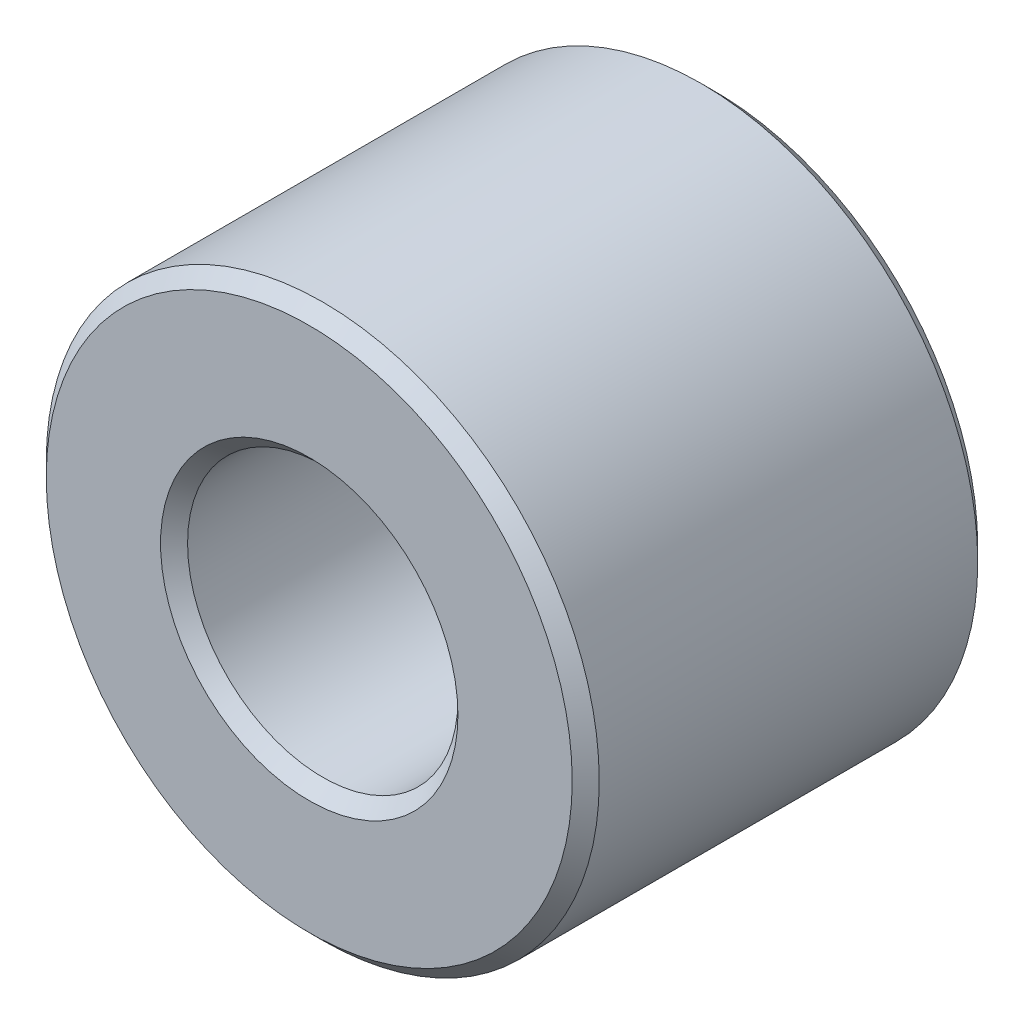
ISO-10303-21;
HEADER;
FILE_DESCRIPTION(('STEP AP214'),'2;1');
FILE_NAME('part.step','',(''),(''),'','','');
FILE_SCHEMA(('AUTOMOTIVE_DESIGN { 1 0 10303 214 1 1 1 1 }'));
ENDSEC;
DATA;
#1=APPLICATION_CONTEXT('core data for automotive mechanical design processes');
#2=APPLICATION_PROTOCOL_DEFINITION('international standard','automotive_design',2000,#1);
#3=PRODUCT_CONTEXT('',#1,'mechanical');
#4=PRODUCT('Part','Part','',(#3));
#5=PRODUCT_RELATED_PRODUCT_CATEGORY('part','',(#4));
#6=PRODUCT_DEFINITION_FORMATION('','',#4);
#7=PRODUCT_DEFINITION_CONTEXT('part definition',#1,'design');
#8=PRODUCT_DEFINITION('design','',#6,#7);
#9=PRODUCT_DEFINITION_SHAPE('','',#8);
#10=(LENGTH_UNIT() NAMED_UNIT(*) SI_UNIT(.MILLI.,.METRE.));
#11=(NAMED_UNIT(*) PLANE_ANGLE_UNIT() SI_UNIT($,.RADIAN.));
#12=(NAMED_UNIT(*) SI_UNIT($,.STERADIAN.) SOLID_ANGLE_UNIT());
#13=UNCERTAINTY_MEASURE_WITH_UNIT(LENGTH_MEASURE(1.E-05),#10,'distance_accuracy_value','');
#14=(GEOMETRIC_REPRESENTATION_CONTEXT(3) GLOBAL_UNCERTAINTY_ASSIGNED_CONTEXT((#13)) GLOBAL_UNIT_ASSIGNED_CONTEXT((#10,
#11,#12)) REPRESENTATION_CONTEXT('',''));
#15=CARTESIAN_POINT('',(0.,0.,0.));
#16=DIRECTION('',(0.,0.,1.));
#17=DIRECTION('',(1.,0.,0.));
#18=AXIS2_PLACEMENT_3D('',#15,#16,#17);
#19=CARTESIAN_POINT('',(0.,0.,16.5));
#20=DIRECTION('',(0.,0.,1.));
#21=DIRECTION('',(1.,0.,0.));
#22=AXIS2_PLACEMENT_3D('',#19,#20,#21);
#23=PLANE('',#22);
#24=CARTESIAN_POINT('',(0.,0.,16.5));
#25=DIRECTION('',(0.,0.,1.));
#26=DIRECTION('',(1.,0.,0.));
#27=AXIS2_PLACEMENT_3D('',#24,#25,#26);
#28=CIRCLE('',#27,12.1);
#29=CARTESIAN_POINT('',(12.1,0.,16.5));
#30=VERTEX_POINT('',#29);
#31=EDGE_CURVE('E10',#30,#30,#28,.F.);
#32=ORIENTED_EDGE('',*,*,#31,.T.);
#33=EDGE_LOOP('',(#32));
#34=FACE_BOUND('',#33,.T.);
#35=CARTESIAN_POINT('',(0.,0.,16.5));
#36=DIRECTION('',(0.,0.,1.));
#37=DIRECTION('',(1.,0.,0.));
#38=AXIS2_PLACEMENT_3D('',#35,#36,#37);
#39=CIRCLE('',#38,21.4);
#40=CARTESIAN_POINT('',(21.4,0.,16.5));
#41=VERTEX_POINT('',#40);
#42=EDGE_CURVE('E45',#41,#41,#39,.T.);
#43=ORIENTED_EDGE('',*,*,#42,.T.);
#44=EDGE_LOOP('',(#43));
#45=FACE_BOUND('',#44,.T.);
#46=ADVANCED_FACE('F37',(#34,#45),#23,.T.);
#47=CARTESIAN_POINT('',(0.,0.,-16.5));
#48=DIRECTION('',(0.,0.,1.));
#49=DIRECTION('',(1.,0.,0.));
#50=AXIS2_PLACEMENT_3D('',#47,#48,#49);
#51=PLANE('',#50);
#52=CARTESIAN_POINT('',(0.,0.,-16.5));
#53=DIRECTION('',(0.,0.,1.));
#54=DIRECTION('',(1.,0.,0.));
#55=AXIS2_PLACEMENT_3D('',#52,#53,#54);
#56=CIRCLE('',#55,12.1);
#57=CARTESIAN_POINT('',(12.1,0.,-16.5));
#58=VERTEX_POINT('',#57);
#59=EDGE_CURVE('E71',#58,#58,#56,.T.);
#60=ORIENTED_EDGE('',*,*,#59,.T.);
#61=EDGE_LOOP('',(#60));
#62=FACE_BOUND('',#61,.T.);
#63=CARTESIAN_POINT('',(0.,0.,-16.5));
#64=DIRECTION('',(0.,0.,1.));
#65=DIRECTION('',(1.,0.,0.));
#66=AXIS2_PLACEMENT_3D('',#63,#64,#65);
#67=CIRCLE('',#66,21.4);
#68=CARTESIAN_POINT('',(21.4,0.,-16.5));
#69=VERTEX_POINT('',#68);
#70=EDGE_CURVE('E74',#69,#69,#67,.F.);
#71=ORIENTED_EDGE('',*,*,#70,.T.);
#72=EDGE_LOOP('',(#71));
#73=FACE_BOUND('',#72,.T.);
#74=ADVANCED_FACE('F78',(#62,#73),#51,.F.);
#75=CARTESIAN_POINT('',(0.,0.,16.5));
#76=DIRECTION('',(0.,0.,-1.));
#77=DIRECTION('',(-1.,0.,0.));
#78=AXIS2_PLACEMENT_3D('',#75,#76,#77);
#79=CYLINDRICAL_SURFACE('',#78,22.5);
#80=CARTESIAN_POINT('',(0.,0.,-15.4));
#81=DIRECTION('',(0.,0.,1.));
#82=DIRECTION('',(1.,0.,0.));
#83=AXIS2_PLACEMENT_3D('',#80,#81,#82);
#84=CIRCLE('',#83,22.5);
#85=CARTESIAN_POINT('',(22.5,0.,-15.4));
#86=VERTEX_POINT('',#85);
#87=EDGE_CURVE('E52',#86,#86,#84,.T.);
#88=ORIENTED_EDGE('',*,*,#87,.T.);
#89=EDGE_LOOP('',(#88));
#90=FACE_BOUND('',#89,.T.);
#91=CARTESIAN_POINT('',(0.,0.,15.4));
#92=DIRECTION('',(0.,0.,1.));
#93=DIRECTION('',(1.,0.,0.));
#94=AXIS2_PLACEMENT_3D('',#91,#92,#93);
#95=CIRCLE('',#94,22.5);
#96=CARTESIAN_POINT('',(22.5,0.,15.4));
#97=VERTEX_POINT('',#96);
#98=EDGE_CURVE('E57',#97,#97,#95,.F.);
#99=ORIENTED_EDGE('',*,*,#98,.T.);
#100=EDGE_LOOP('',(#99));
#101=FACE_BOUND('',#100,.T.);
#102=ADVANCED_FACE('F88',(#90,#101),#79,.T.);
#103=CARTESIAN_POINT('',(0.,0.,16.5));
#104=DIRECTION('',(0.,0.,-1.));
#105=DIRECTION('',(-1.,0.,0.));
#106=AXIS2_PLACEMENT_3D('',#103,#104,#105);
#107=CYLINDRICAL_SURFACE('',#106,11.);
#108=CARTESIAN_POINT('',(0.,0.,-15.4));
#109=DIRECTION('',(0.,0.,1.));
#110=DIRECTION('',(1.,0.,0.));
#111=AXIS2_PLACEMENT_3D('',#108,#109,#110);
#112=CIRCLE('',#111,11.);
#113=CARTESIAN_POINT('',(11.,0.,-15.4));
#114=VERTEX_POINT('',#113);
#115=EDGE_CURVE('E63',#114,#114,#112,.F.);
#116=ORIENTED_EDGE('',*,*,#115,.T.);
#117=EDGE_LOOP('',(#116));
#118=FACE_BOUND('',#117,.T.);
#119=CARTESIAN_POINT('',(0.,0.,15.4));
#120=DIRECTION('',(0.,0.,1.));
#121=DIRECTION('',(1.,0.,0.));
#122=AXIS2_PLACEMENT_3D('',#119,#120,#121);
#123=CIRCLE('',#122,11.);
#124=CARTESIAN_POINT('',(11.,0.,15.4));
#125=VERTEX_POINT('',#124);
#126=EDGE_CURVE('E67',#125,#125,#123,.T.);
#127=ORIENTED_EDGE('',*,*,#126,.T.);
#128=EDGE_LOOP('',(#127));
#129=FACE_BOUND('',#128,.T.);
#130=ADVANCED_FACE('F91',(#118,#129),#107,.F.);
#131=CARTESIAN_POINT('',(0.,0.,-16.5));
#132=DIRECTION('',(0.,0.,-1.));
#133=DIRECTION('',(-1.,0.,0.));
#134=AXIS2_PLACEMENT_3D('',#131,#132,#133);
#135=CONICAL_SURFACE('',#134,12.1,0.785398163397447);
#136=ORIENTED_EDGE('',*,*,#115,.F.);
#137=EDGE_LOOP('',(#136));
#138=FACE_BOUND('',#137,.T.);
#139=ORIENTED_EDGE('',*,*,#59,.F.);
#140=EDGE_LOOP('',(#139));
#141=FACE_BOUND('',#140,.T.);
#142=ADVANCED_FACE('F84',(#138,#141),#135,.F.);
#143=CARTESIAN_POINT('',(0.,0.,-15.4));
#144=DIRECTION('',(0.,0.,1.));
#145=DIRECTION('',(1.,0.,0.));
#146=AXIS2_PLACEMENT_3D('',#143,#144,#145);
#147=CONICAL_SURFACE('',#146,22.5,0.785398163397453);
#148=CARTESIAN_POINT('',(21.4,0.,-16.5));
#149=CARTESIAN_POINT('',(21.4114583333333,0.,-16.4885416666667));
#150=CARTESIAN_POINT('',(21.4229166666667,0.,-16.4770833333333));
#151=CARTESIAN_POINT('',(21.4458333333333,0.,-16.4541666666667));
#152=CARTESIAN_POINT('',(21.4572916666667,0.,-16.4427083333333));
#153=CARTESIAN_POINT('',(21.4802083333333,0.,-16.4197916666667));
#154=CARTESIAN_POINT('',(21.4916666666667,0.,-16.4083333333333));
#155=CARTESIAN_POINT('',(21.5145833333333,0.,-16.3854166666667));
#156=CARTESIAN_POINT('',(21.5260416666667,0.,-16.3739583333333));
#157=CARTESIAN_POINT('',(21.5489583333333,0.,-16.3510416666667));
#158=CARTESIAN_POINT('',(21.5604166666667,0.,-16.3395833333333));
#159=CARTESIAN_POINT('',(21.5833333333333,0.,-16.3166666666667));
#160=CARTESIAN_POINT('',(21.5947916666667,0.,-16.3052083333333));
#161=CARTESIAN_POINT('',(21.6177083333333,0.,-16.2822916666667));
#162=CARTESIAN_POINT('',(21.6291666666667,0.,-16.2708333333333));
#163=CARTESIAN_POINT('',(21.6520833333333,0.,-16.2479166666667));
#164=CARTESIAN_POINT('',(21.6635416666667,0.,-16.2364583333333));
#165=CARTESIAN_POINT('',(21.6864583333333,0.,-16.2135416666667));
#166=CARTESIAN_POINT('',(21.6979166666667,0.,-16.2020833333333));
#167=CARTESIAN_POINT('',(21.7208333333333,0.,-16.1791666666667));
#168=CARTESIAN_POINT('',(21.7322916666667,0.,-16.1677083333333));
#169=CARTESIAN_POINT('',(21.7552083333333,0.,-16.1447916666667));
#170=CARTESIAN_POINT('',(21.7666666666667,0.,-16.1333333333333));
#171=CARTESIAN_POINT('',(21.7895833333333,0.,-16.1104166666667));
#172=CARTESIAN_POINT('',(21.8010416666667,0.,-16.0989583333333));
#173=CARTESIAN_POINT('',(21.8239583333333,0.,-16.0760416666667));
#174=CARTESIAN_POINT('',(21.8354166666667,0.,-16.0645833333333));
#175=CARTESIAN_POINT('',(21.8583333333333,0.,-16.0416666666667));
#176=CARTESIAN_POINT('',(21.8697916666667,0.,-16.0302083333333));
#177=CARTESIAN_POINT('',(21.8927083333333,0.,-16.0072916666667));
#178=CARTESIAN_POINT('',(21.9041666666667,0.,-15.9958333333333));
#179=CARTESIAN_POINT('',(21.9270833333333,0.,-15.9729166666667));
#180=CARTESIAN_POINT('',(21.9385416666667,0.,-15.9614583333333));
#181=CARTESIAN_POINT('',(21.9614583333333,0.,-15.9385416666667));
#182=CARTESIAN_POINT('',(21.9729166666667,0.,-15.9270833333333));
#183=CARTESIAN_POINT('',(21.9958333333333,0.,-15.9041666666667));
#184=CARTESIAN_POINT('',(22.0072916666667,0.,-15.8927083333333));
#185=CARTESIAN_POINT('',(22.0302083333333,0.,-15.8697916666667));
#186=CARTESIAN_POINT('',(22.0416666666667,0.,-15.8583333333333));
#187=CARTESIAN_POINT('',(22.0645833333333,0.,-15.8354166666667));
#188=CARTESIAN_POINT('',(22.0760416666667,0.,-15.8239583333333));
#189=CARTESIAN_POINT('',(22.0989583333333,0.,-15.8010416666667));
#190=CARTESIAN_POINT('',(22.1104166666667,0.,-15.7895833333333));
#191=CARTESIAN_POINT('',(22.1333333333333,0.,-15.7666666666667));
#192=CARTESIAN_POINT('',(22.1447916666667,0.,-15.7552083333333));
#193=CARTESIAN_POINT('',(22.1677083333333,0.,-15.7322916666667));
#194=CARTESIAN_POINT('',(22.1791666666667,0.,-15.7208333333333));
#195=CARTESIAN_POINT('',(22.2020833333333,0.,-15.6979166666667));
#196=CARTESIAN_POINT('',(22.2135416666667,0.,-15.6864583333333));
#197=CARTESIAN_POINT('',(22.2364583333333,0.,-15.6635416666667));
#198=CARTESIAN_POINT('',(22.2479166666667,0.,-15.6520833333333));
#199=CARTESIAN_POINT('',(22.2708333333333,0.,-15.6291666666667));
#200=CARTESIAN_POINT('',(22.2822916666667,0.,-15.6177083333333));
#201=CARTESIAN_POINT('',(22.3052083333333,0.,-15.5947916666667));
#202=CARTESIAN_POINT('',(22.3166666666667,0.,-15.5833333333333));
#203=CARTESIAN_POINT('',(22.3395833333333,0.,-15.5604166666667));
#204=CARTESIAN_POINT('',(22.3510416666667,0.,-15.5489583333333));
#205=CARTESIAN_POINT('',(22.3739583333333,0.,-15.5260416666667));
#206=CARTESIAN_POINT('',(22.3854166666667,0.,-15.5145833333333));
#207=CARTESIAN_POINT('',(22.4083333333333,0.,-15.4916666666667));
#208=CARTESIAN_POINT('',(22.4197916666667,0.,-15.4802083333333));
#209=CARTESIAN_POINT('',(22.4427083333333,0.,-15.4572916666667));
#210=CARTESIAN_POINT('',(22.4541666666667,0.,-15.4458333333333));
#211=CARTESIAN_POINT('',(22.4770833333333,0.,-15.4229166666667));
#212=CARTESIAN_POINT('',(22.4885416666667,0.,-15.4114583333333));
#213=CARTESIAN_POINT('',(22.5,0.,-15.4));
#214=B_SPLINE_CURVE_WITH_KNOTS('',3,(#148,#149,#150,#151,#152,#153,#154,#155,#156,#157,#158,
#159,#160,#161,#162,#163,#164,#165,#166,#167,#168,#169,#170,#171,#172,#173,#174,#175,#176,#177,
#178,#179,#180,#181,#182,#183,#184,#185,#186,#187,#188,#189,#190,#191,#192,#193,#194,#195,#196,
#197,#198,#199,#200,#201,#202,#203,#204,#205,#206,#207,#208,#209,#210,#211,#212,#213),
.UNSPECIFIED.,.F.,.F.,(4,2,2,2,2,2,2,2,2,2,2,2,2,2,2,2,2,2,2,2,2,2,2,2,2,2,2,2,2,2,2,2,4),(0.,
0.0486135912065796,0.0972271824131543,0.145840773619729,0.194454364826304,0.243067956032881,
0.291681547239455,0.34029513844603,0.388908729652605,0.437522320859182,0.486135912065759,
0.534749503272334,0.583363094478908,0.631976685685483,0.68059027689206,0.729203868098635,
0.777817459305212,0.826431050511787,0.875044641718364,0.923658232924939,0.972271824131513,
1.02088541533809,1.06949900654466,1.11811259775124,1.16672618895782,1.21533978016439,
1.26395337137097,1.31256696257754,1.36118055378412,1.40979414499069,1.45840773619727,
1.50702132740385,1.55563491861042),.UNSPECIFIED.);
#215=EDGE_CURVE('BSEAM80',#69,#86,#214,.T.);
#216=ORIENTED_EDGE('',*,*,#70,.F.);
#217=ORIENTED_EDGE('',*,*,#87,.F.);
#218=ORIENTED_EDGE('',*,*,#215,.T.);
#219=ORIENTED_EDGE('',*,*,#215,.F.);
#220=EDGE_LOOP('',(#216,#218,#217,#219));
#221=FACE_BOUND('',#220,.T.);
#222=ADVANCED_FACE('F80',(#221),#147,.T.);
#223=CARTESIAN_POINT('',(0.,0.,15.4));
#224=DIRECTION('',(0.,0.,1.));
#225=DIRECTION('',(1.,0.,0.));
#226=AXIS2_PLACEMENT_3D('',#223,#224,#225);
#227=CONICAL_SURFACE('',#226,11.,0.78539816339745);
#228=ORIENTED_EDGE('',*,*,#31,.F.);
#229=EDGE_LOOP('',(#228));
#230=FACE_BOUND('',#229,.T.);
#231=ORIENTED_EDGE('',*,*,#126,.F.);
#232=EDGE_LOOP('',(#231));
#233=FACE_BOUND('',#232,.T.);
#234=ADVANCED_FACE('F83',(#230,#233),#227,.F.);
#235=CARTESIAN_POINT('',(0.,0.,16.5));
#236=DIRECTION('',(0.,0.,-1.));
#237=DIRECTION('',(-1.,0.,0.));
#238=AXIS2_PLACEMENT_3D('',#235,#236,#237);
#239=CONICAL_SURFACE('',#238,21.4,0.785398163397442);
#240=ORIENTED_EDGE('',*,*,#98,.F.);
#241=EDGE_LOOP('',(#240));
#242=FACE_BOUND('',#241,.T.);
#243=ORIENTED_EDGE('',*,*,#42,.F.);
#244=EDGE_LOOP('',(#243));
#245=FACE_BOUND('',#244,.T.);
#246=ADVANCED_FACE('F39',(#242,#245),#239,.T.);
#247=CLOSED_SHELL('',(#46,#74,#102,#130,#142,#222,#234,#246));
#248=MANIFOLD_SOLID_BREP('B2',#247);
#249=ADVANCED_BREP_SHAPE_REPRESENTATION('',(#18,#248),#14);
#250=SHAPE_DEFINITION_REPRESENTATION(#9,#249);
ENDSEC;
END-ISO-10303-21;
